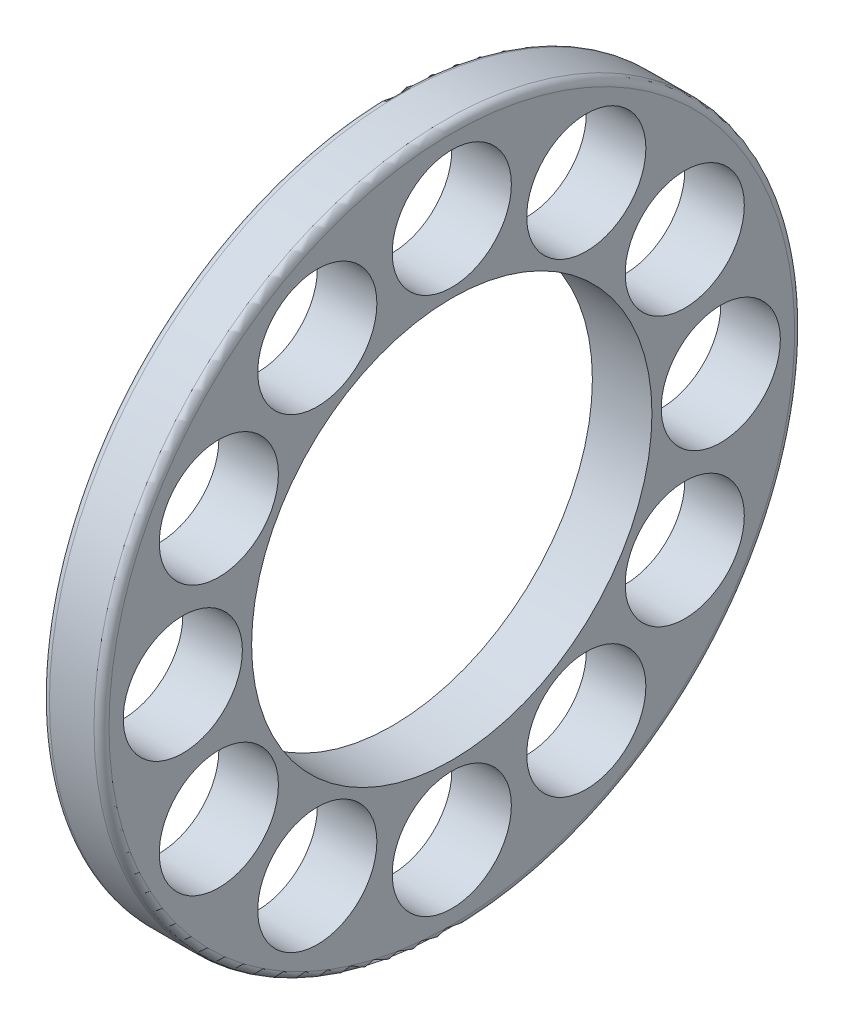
ISO-10303-21;
HEADER;
FILE_DESCRIPTION(('STEP AP214'),'2;1');
FILE_NAME('part.step','',(''),(''),'','','');
FILE_SCHEMA(('AUTOMOTIVE_DESIGN { 1 0 10303 214 1 1 1 1 }'));
ENDSEC;
DATA;
#1=APPLICATION_CONTEXT('core data for automotive mechanical design processes');
#2=APPLICATION_PROTOCOL_DEFINITION('international standard','automotive_design',2000,#1);
#3=PRODUCT_CONTEXT('',#1,'mechanical');
#4=PRODUCT('Part','Part','',(#3));
#5=PRODUCT_RELATED_PRODUCT_CATEGORY('part','',(#4));
#6=PRODUCT_DEFINITION_FORMATION('','',#4);
#7=PRODUCT_DEFINITION_CONTEXT('part definition',#1,'design');
#8=PRODUCT_DEFINITION('design','',#6,#7);
#9=PRODUCT_DEFINITION_SHAPE('','',#8);
#10=(LENGTH_UNIT() NAMED_UNIT(*) SI_UNIT(.MILLI.,.METRE.));
#11=(NAMED_UNIT(*) PLANE_ANGLE_UNIT() SI_UNIT($,.RADIAN.));
#12=(NAMED_UNIT(*) SI_UNIT($,.STERADIAN.) SOLID_ANGLE_UNIT());
#13=UNCERTAINTY_MEASURE_WITH_UNIT(LENGTH_MEASURE(1.E-05),#10,'distance_accuracy_value','');
#14=(GEOMETRIC_REPRESENTATION_CONTEXT(3) GLOBAL_UNCERTAINTY_ASSIGNED_CONTEXT((#13)) GLOBAL_UNIT_ASSIGNED_CONTEXT((#10,
#11,#12)) REPRESENTATION_CONTEXT('',''));
#15=CARTESIAN_POINT('',(0.,0.,0.));
#16=DIRECTION('',(0.,0.,1.));
#17=DIRECTION('',(1.,0.,0.));
#18=AXIS2_PLACEMENT_3D('',#15,#16,#17);
#19=CARTESIAN_POINT('',(3.3095,-13.9544959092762,-13.7));
#20=DIRECTION('',(-1.,0.,0.));
#21=DIRECTION('',(0.,0.,1.));
#22=AXIS2_PLACEMENT_3D('',#19,#20,#21);
#23=PLANE('',#22);
#24=CARTESIAN_POINT('',(3.3095,0.,0.));
#25=DIRECTION('',(-1.,0.,0.));
#26=DIRECTION('',(0.,0.,-1.));
#27=AXIS2_PLACEMENT_3D('',#24,#25,#26);
#28=CIRCLE('',#27,13.7000000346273);
#29=CARTESIAN_POINT('',(3.3095,0.,-13.7000000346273));
#30=VERTEX_POINT('',#29);
#31=EDGE_CURVE('E110',#30,#30,#28,.F.);
#32=ORIENTED_EDGE('',*,*,#31,.F.);
#33=EDGE_LOOP('',(#32));
#34=FACE_BOUND('',#33,.T.);
#35=CARTESIAN_POINT('',(3.3095,0.,0.));
#36=DIRECTION('',(1.,0.,0.));
#37=DIRECTION('',(0.,0.,1.));
#38=AXIS2_PLACEMENT_3D('',#35,#36,#37);
#39=CIRCLE('',#38,8.);
#40=CARTESIAN_POINT('',(3.3095,0.,8.));
#41=VERTEX_POINT('',#40);
#42=EDGE_CURVE('E107',#41,#41,#39,.T.);
#43=ORIENTED_EDGE('',*,*,#42,.T.);
#44=EDGE_LOOP('',(#43));
#45=FACE_BOUND('',#44,.T.);
#46=CARTESIAN_POINT('',(3.3095,5.375,9.3097730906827));
#47=DIRECTION('',(1.,0.,0.));
#48=DIRECTION('',(0.,0.,1.));
#49=AXIS2_PLACEMENT_3D('',#46,#47,#48);
#50=CIRCLE('',#49,2.381);
#51=CARTESIAN_POINT('',(3.3095,5.375,11.6907730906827));
#52=VERTEX_POINT('',#51);
#53=EDGE_CURVE('E104',#52,#52,#50,.T.);
#54=ORIENTED_EDGE('',*,*,#53,.T.);
#55=EDGE_LOOP('',(#54));
#56=FACE_BOUND('',#55,.T.);
#57=CARTESIAN_POINT('',(3.3095,0.,10.75));
#58=DIRECTION('',(1.,0.,0.));
#59=DIRECTION('',(0.,0.,1.));
#60=AXIS2_PLACEMENT_3D('',#57,#58,#59);
#61=CIRCLE('',#60,2.381);
#62=CARTESIAN_POINT('',(3.3095,0.,13.131));
#63=VERTEX_POINT('',#62);
#64=EDGE_CURVE('E101',#63,#63,#61,.T.);
#65=ORIENTED_EDGE('',*,*,#64,.T.);
#66=EDGE_LOOP('',(#65));
#67=FACE_BOUND('',#66,.T.);
#68=CARTESIAN_POINT('',(3.3095,-9.3097730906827,5.375));
#69=DIRECTION('',(1.,0.,0.));
#70=DIRECTION('',(0.,0.,1.));
#71=AXIS2_PLACEMENT_3D('',#68,#69,#70);
#72=CIRCLE('',#71,2.381);
#73=CARTESIAN_POINT('',(3.3095,-9.3097730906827,7.756));
#74=VERTEX_POINT('',#73);
#75=EDGE_CURVE('E98',#74,#74,#72,.T.);
#76=ORIENTED_EDGE('',*,*,#75,.T.);
#77=EDGE_LOOP('',(#76));
#78=FACE_BOUND('',#77,.T.);
#79=CARTESIAN_POINT('',(3.3095,-5.375,9.3097730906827));
#80=DIRECTION('',(1.,0.,0.));
#81=DIRECTION('',(0.,0.,1.));
#82=AXIS2_PLACEMENT_3D('',#79,#80,#81);
#83=CIRCLE('',#82,2.381);
#84=CARTESIAN_POINT('',(3.3095,-5.375,11.6907730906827));
#85=VERTEX_POINT('',#84);
#86=EDGE_CURVE('E95',#85,#85,#83,.T.);
#87=ORIENTED_EDGE('',*,*,#86,.T.);
#88=EDGE_LOOP('',(#87));
#89=FACE_BOUND('',#88,.T.);
#90=CARTESIAN_POINT('',(3.3095,0.,-10.75));
#91=DIRECTION('',(1.,0.,0.));
#92=DIRECTION('',(0.,0.,1.));
#93=AXIS2_PLACEMENT_3D('',#90,#91,#92);
#94=CIRCLE('',#93,2.381);
#95=CARTESIAN_POINT('',(3.3095,0.,-8.369));
#96=VERTEX_POINT('',#95);
#97=EDGE_CURVE('E92',#96,#96,#94,.T.);
#98=ORIENTED_EDGE('',*,*,#97,.T.);
#99=EDGE_LOOP('',(#98));
#100=FACE_BOUND('',#99,.T.);
#101=CARTESIAN_POINT('',(3.3095,-5.375,-9.3097730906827));
#102=DIRECTION('',(1.,0.,0.));
#103=DIRECTION('',(0.,0.,1.));
#104=AXIS2_PLACEMENT_3D('',#101,#102,#103);
#105=CIRCLE('',#104,2.381);
#106=CARTESIAN_POINT('',(3.3095,-5.375,-6.9287730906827));
#107=VERTEX_POINT('',#106);
#108=EDGE_CURVE('E89',#107,#107,#105,.T.);
#109=ORIENTED_EDGE('',*,*,#108,.T.);
#110=EDGE_LOOP('',(#109));
#111=FACE_BOUND('',#110,.T.);
#112=CARTESIAN_POINT('',(3.3095,-9.3097730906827,-5.375));
#113=DIRECTION('',(1.,0.,0.));
#114=DIRECTION('',(0.,0.,1.));
#115=AXIS2_PLACEMENT_3D('',#112,#113,#114);
#116=CIRCLE('',#115,2.381);
#117=CARTESIAN_POINT('',(3.3095,-9.3097730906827,-2.994));
#118=VERTEX_POINT('',#117);
#119=EDGE_CURVE('E86',#118,#118,#116,.T.);
#120=ORIENTED_EDGE('',*,*,#119,.T.);
#121=EDGE_LOOP('',(#120));
#122=FACE_BOUND('',#121,.T.);
#123=CARTESIAN_POINT('',(3.3095,-10.75,0.));
#124=DIRECTION('',(1.,0.,0.));
#125=DIRECTION('',(0.,0.,1.));
#126=AXIS2_PLACEMENT_3D('',#123,#124,#125);
#127=CIRCLE('',#126,2.381);
#128=CARTESIAN_POINT('',(3.3095,-10.75,2.381));
#129=VERTEX_POINT('',#128);
#130=EDGE_CURVE('E83',#129,#129,#127,.T.);
#131=ORIENTED_EDGE('',*,*,#130,.T.);
#132=EDGE_LOOP('',(#131));
#133=FACE_BOUND('',#132,.T.);
#134=CARTESIAN_POINT('',(3.3095,9.3097730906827,-5.375));
#135=DIRECTION('',(1.,0.,0.));
#136=DIRECTION('',(0.,0.,1.));
#137=AXIS2_PLACEMENT_3D('',#134,#135,#136);
#138=CIRCLE('',#137,2.381);
#139=CARTESIAN_POINT('',(3.3095,9.30977309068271,-2.994));
#140=VERTEX_POINT('',#139);
#141=EDGE_CURVE('E80',#140,#140,#138,.T.);
#142=ORIENTED_EDGE('',*,*,#141,.T.);
#143=EDGE_LOOP('',(#142));
#144=FACE_BOUND('',#143,.T.);
#145=CARTESIAN_POINT('',(3.3095,5.375,-9.3097730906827));
#146=DIRECTION('',(1.,0.,0.));
#147=DIRECTION('',(0.,0.,1.));
#148=AXIS2_PLACEMENT_3D('',#145,#146,#147);
#149=CIRCLE('',#148,2.381);
#150=CARTESIAN_POINT('',(3.3095,5.375,-6.9287730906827));
#151=VERTEX_POINT('',#150);
#152=EDGE_CURVE('E77',#151,#151,#149,.T.);
#153=ORIENTED_EDGE('',*,*,#152,.T.);
#154=EDGE_LOOP('',(#153));
#155=FACE_BOUND('',#154,.T.);
#156=CARTESIAN_POINT('',(3.3095,9.3097730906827,5.375));
#157=DIRECTION('',(1.,0.,0.));
#158=DIRECTION('',(0.,0.,1.));
#159=AXIS2_PLACEMENT_3D('',#156,#157,#158);
#160=CIRCLE('',#159,2.381);
#161=CARTESIAN_POINT('',(3.3095,9.30977309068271,7.756));
#162=VERTEX_POINT('',#161);
#163=EDGE_CURVE('E74',#162,#162,#160,.T.);
#164=ORIENTED_EDGE('',*,*,#163,.T.);
#165=EDGE_LOOP('',(#164));
#166=FACE_BOUND('',#165,.T.);
#167=CARTESIAN_POINT('',(3.3095,10.75,0.));
#168=DIRECTION('',(1.,0.,0.));
#169=DIRECTION('',(0.,0.,1.));
#170=AXIS2_PLACEMENT_3D('',#167,#168,#169);
#171=CIRCLE('',#170,2.381);
#172=CARTESIAN_POINT('',(3.3095,10.75,2.381));
#173=VERTEX_POINT('',#172);
#174=EDGE_CURVE('E71',#173,#173,#171,.T.);
#175=ORIENTED_EDGE('',*,*,#174,.T.);
#176=EDGE_LOOP('',(#175));
#177=FACE_BOUND('',#176,.T.);
#178=ADVANCED_FACE('F15',(#34,#45,#56,#67,#78,#89,#100,#111,#122,#133,#144,#155,#166,#177),#23,.T.);
#179=CARTESIAN_POINT('',(5.6905,-13.9544959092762,13.7));
#180=DIRECTION('',(1.,0.,0.));
#181=DIRECTION('',(0.,0.,-1.));
#182=AXIS2_PLACEMENT_3D('',#179,#180,#181);
#183=PLANE('',#182);
#184=CARTESIAN_POINT('',(5.6905,0.,0.));
#185=DIRECTION('',(1.,0.,0.));
#186=DIRECTION('',(0.,0.,1.));
#187=AXIS2_PLACEMENT_3D('',#184,#185,#186);
#188=CIRCLE('',#187,13.7);
#189=CARTESIAN_POINT('',(5.6905,0.,13.7));
#190=VERTEX_POINT('',#189);
#191=EDGE_CURVE('E68',#190,#190,#188,.T.);
#192=ORIENTED_EDGE('',*,*,#191,.T.);
#193=EDGE_LOOP('',(#192));
#194=FACE_BOUND('',#193,.T.);
#195=CARTESIAN_POINT('',(5.6905,0.,0.));
#196=DIRECTION('',(-1.,0.,0.));
#197=DIRECTION('',(0.,0.,-1.));
#198=AXIS2_PLACEMENT_3D('',#195,#196,#197);
#199=CIRCLE('',#198,8.);
#200=CARTESIAN_POINT('',(5.6905,0.,-8.));
#201=VERTEX_POINT('',#200);
#202=EDGE_CURVE('E65',#201,#201,#199,.F.);
#203=ORIENTED_EDGE('',*,*,#202,.F.);
#204=EDGE_LOOP('',(#203));
#205=FACE_BOUND('',#204,.T.);
#206=CARTESIAN_POINT('',(5.6905,5.375,9.3097730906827));
#207=DIRECTION('',(-1.,0.,0.));
#208=DIRECTION('',(0.,0.,-1.));
#209=AXIS2_PLACEMENT_3D('',#206,#207,#208);
#210=CIRCLE('',#209,2.381);
#211=CARTESIAN_POINT('',(5.6905,5.375,6.9287730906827));
#212=VERTEX_POINT('',#211);
#213=EDGE_CURVE('E62',#212,#212,#210,.T.);
#214=ORIENTED_EDGE('',*,*,#213,.T.);
#215=EDGE_LOOP('',(#214));
#216=FACE_BOUND('',#215,.T.);
#217=CARTESIAN_POINT('',(5.6905,0.,10.75));
#218=DIRECTION('',(-1.,0.,0.));
#219=DIRECTION('',(0.,0.,-1.));
#220=AXIS2_PLACEMENT_3D('',#217,#218,#219);
#221=CIRCLE('',#220,2.381);
#222=CARTESIAN_POINT('',(5.6905,0.,8.369));
#223=VERTEX_POINT('',#222);
#224=EDGE_CURVE('E59',#223,#223,#221,.T.);
#225=ORIENTED_EDGE('',*,*,#224,.T.);
#226=EDGE_LOOP('',(#225));
#227=FACE_BOUND('',#226,.T.);
#228=CARTESIAN_POINT('',(5.6905,-9.3097730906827,5.375));
#229=DIRECTION('',(-1.,0.,0.));
#230=DIRECTION('',(0.,0.,-1.));
#231=AXIS2_PLACEMENT_3D('',#228,#229,#230);
#232=CIRCLE('',#231,2.381);
#233=CARTESIAN_POINT('',(5.6905,-9.3097730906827,2.994));
#234=VERTEX_POINT('',#233);
#235=EDGE_CURVE('E56',#234,#234,#232,.T.);
#236=ORIENTED_EDGE('',*,*,#235,.T.);
#237=EDGE_LOOP('',(#236));
#238=FACE_BOUND('',#237,.T.);
#239=CARTESIAN_POINT('',(5.6905,-5.375,9.3097730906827));
#240=DIRECTION('',(-1.,0.,0.));
#241=DIRECTION('',(0.,0.,-1.));
#242=AXIS2_PLACEMENT_3D('',#239,#240,#241);
#243=CIRCLE('',#242,2.381);
#244=CARTESIAN_POINT('',(5.6905,-5.375,6.9287730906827));
#245=VERTEX_POINT('',#244);
#246=EDGE_CURVE('E53',#245,#245,#243,.T.);
#247=ORIENTED_EDGE('',*,*,#246,.T.);
#248=EDGE_LOOP('',(#247));
#249=FACE_BOUND('',#248,.T.);
#250=CARTESIAN_POINT('',(5.6905,0.,-10.75));
#251=DIRECTION('',(-1.,0.,0.));
#252=DIRECTION('',(0.,0.,-1.));
#253=AXIS2_PLACEMENT_3D('',#250,#251,#252);
#254=CIRCLE('',#253,2.381);
#255=CARTESIAN_POINT('',(5.6905,0.,-13.131));
#256=VERTEX_POINT('',#255);
#257=EDGE_CURVE('E50',#256,#256,#254,.T.);
#258=ORIENTED_EDGE('',*,*,#257,.T.);
#259=EDGE_LOOP('',(#258));
#260=FACE_BOUND('',#259,.T.);
#261=CARTESIAN_POINT('',(5.6905,-5.375,-9.3097730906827));
#262=DIRECTION('',(-1.,0.,0.));
#263=DIRECTION('',(0.,0.,-1.));
#264=AXIS2_PLACEMENT_3D('',#261,#262,#263);
#265=CIRCLE('',#264,2.381);
#266=CARTESIAN_POINT('',(5.6905,-5.375,-11.6907730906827));
#267=VERTEX_POINT('',#266);
#268=EDGE_CURVE('E47',#267,#267,#265,.T.);
#269=ORIENTED_EDGE('',*,*,#268,.T.);
#270=EDGE_LOOP('',(#269));
#271=FACE_BOUND('',#270,.T.);
#272=CARTESIAN_POINT('',(5.6905,-9.3097730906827,-5.375));
#273=DIRECTION('',(-1.,0.,0.));
#274=DIRECTION('',(0.,0.,-1.));
#275=AXIS2_PLACEMENT_3D('',#272,#273,#274);
#276=CIRCLE('',#275,2.381);
#277=CARTESIAN_POINT('',(5.6905,-9.3097730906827,-7.756));
#278=VERTEX_POINT('',#277);
#279=EDGE_CURVE('E44',#278,#278,#276,.T.);
#280=ORIENTED_EDGE('',*,*,#279,.T.);
#281=EDGE_LOOP('',(#280));
#282=FACE_BOUND('',#281,.T.);
#283=CARTESIAN_POINT('',(5.6905,-10.75,0.));
#284=DIRECTION('',(-1.,0.,0.));
#285=DIRECTION('',(0.,0.,-1.));
#286=AXIS2_PLACEMENT_3D('',#283,#284,#285);
#287=CIRCLE('',#286,2.381);
#288=CARTESIAN_POINT('',(5.6905,-10.75,-2.381));
#289=VERTEX_POINT('',#288);
#290=EDGE_CURVE('E41',#289,#289,#287,.T.);
#291=ORIENTED_EDGE('',*,*,#290,.T.);
#292=EDGE_LOOP('',(#291));
#293=FACE_BOUND('',#292,.T.);
#294=CARTESIAN_POINT('',(5.6905,9.3097730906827,-5.375));
#295=DIRECTION('',(-1.,0.,0.));
#296=DIRECTION('',(0.,-1.42053928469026E-07,-0.99999999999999));
#297=AXIS2_PLACEMENT_3D('',#294,#295,#296);
#298=CIRCLE('',#297,2.381);
#299=CARTESIAN_POINT('',(5.6905,9.3097727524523,-7.75599999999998));
#300=VERTEX_POINT('',#299);
#301=EDGE_CURVE('E38',#300,#300,#298,.T.);
#302=ORIENTED_EDGE('',*,*,#301,.T.);
#303=EDGE_LOOP('',(#302));
#304=FACE_BOUND('',#303,.T.);
#305=CARTESIAN_POINT('',(5.6905,5.375,-9.3097730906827));
#306=DIRECTION('',(-1.,0.,0.));
#307=DIRECTION('',(0.,0.,-1.));
#308=AXIS2_PLACEMENT_3D('',#305,#306,#307);
#309=CIRCLE('',#308,2.381);
#310=CARTESIAN_POINT('',(5.6905,5.375,-11.6907730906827));
#311=VERTEX_POINT('',#310);
#312=EDGE_CURVE('E35',#311,#311,#309,.T.);
#313=ORIENTED_EDGE('',*,*,#312,.T.);
#314=EDGE_LOOP('',(#313));
#315=FACE_BOUND('',#314,.T.);
#316=CARTESIAN_POINT('',(5.6905,9.3097730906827,5.375));
#317=DIRECTION('',(-1.,0.,0.));
#318=DIRECTION('',(0.,0.,-1.));
#319=AXIS2_PLACEMENT_3D('',#316,#317,#318);
#320=CIRCLE('',#319,2.381);
#321=CARTESIAN_POINT('',(5.6905,9.3097730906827,2.994));
#322=VERTEX_POINT('',#321);
#323=EDGE_CURVE('E30',#322,#322,#320,.T.);
#324=ORIENTED_EDGE('',*,*,#323,.T.);
#325=EDGE_LOOP('',(#324));
#326=FACE_BOUND('',#325,.T.);
#327=CARTESIAN_POINT('',(5.6905,10.75,0.));
#328=DIRECTION('',(-1.,0.,0.));
#329=DIRECTION('',(0.,-1.42053904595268E-07,-0.99999999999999));
#330=AXIS2_PLACEMENT_3D('',#327,#328,#329);
#331=CIRCLE('',#330,2.381);
#332=CARTESIAN_POINT('',(5.6905,10.7499996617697,-2.38099999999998));
#333=VERTEX_POINT('',#332);
#334=EDGE_CURVE('E26',#333,#333,#331,.T.);
#335=ORIENTED_EDGE('',*,*,#334,.T.);
#336=EDGE_LOOP('',(#335));
#337=FACE_BOUND('',#336,.T.);
#338=ADVANCED_FACE('F119',(#194,#205,#216,#227,#238,#249,#260,#271,#282,#293,#304,#315,#326,
#337),#183,.T.);
#339=CARTESIAN_POINT('',(3.60949999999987,0.,0.));
#340=DIRECTION('',(1.,0.,0.));
#341=DIRECTION('',(0.,1.92336047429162E-10,1.));
#342=AXIS2_PLACEMENT_3D('',#339,#340,#341);
#343=TOROIDAL_SURFACE('',#342,13.7000000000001,0.299999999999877);
#344=ORIENTED_EDGE('',*,*,#31,.T.);
#345=EDGE_LOOP('',(#344));
#346=FACE_BOUND('',#345,.T.);
#347=CARTESIAN_POINT('',(3.60949999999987,0.,0.));
#348=DIRECTION('',(-1.,0.,0.));
#349=DIRECTION('',(0.,0.,-1.));
#350=AXIS2_PLACEMENT_3D('',#347,#348,#349);
#351=CIRCLE('',#350,14.);
#352=CARTESIAN_POINT('',(3.60949999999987,0.,-14.));
#353=VERTEX_POINT('',#352);
#354=EDGE_CURVE('E22',#353,#353,#351,.F.);
#355=ORIENTED_EDGE('',*,*,#354,.F.);
#356=EDGE_LOOP('',(#355));
#357=FACE_BOUND('',#356,.T.);
#358=ADVANCED_FACE('F114',(#346,#357),#343,.T.);
#359=CARTESIAN_POINT('',(5.6905,0.,0.));
#360=DIRECTION('',(1.,0.,0.));
#361=DIRECTION('',(0.,0.,1.));
#362=AXIS2_PLACEMENT_3D('',#359,#360,#361);
#363=CYLINDRICAL_SURFACE('',#362,8.);
#364=ORIENTED_EDGE('',*,*,#202,.T.);
#365=EDGE_LOOP('',(#364));
#366=FACE_BOUND('',#365,.T.);
#367=ORIENTED_EDGE('',*,*,#42,.F.);
#368=EDGE_LOOP('',(#367));
#369=FACE_BOUND('',#368,.T.);
#370=ADVANCED_FACE('F162',(#366,#369),#363,.F.);
#371=CARTESIAN_POINT('',(5.39050000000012,0.,0.));
#372=DIRECTION('',(1.,0.,0.));
#373=DIRECTION('',(0.,0.,1.));
#374=AXIS2_PLACEMENT_3D('',#371,#372,#373);
#375=TOROIDAL_SURFACE('',#374,13.7000000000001,0.299999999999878);
#376=CARTESIAN_POINT('',(5.39050000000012,0.,0.));
#377=DIRECTION('',(1.,0.,0.));
#378=DIRECTION('',(0.,0.,1.));
#379=AXIS2_PLACEMENT_3D('',#376,#377,#378);
#380=CIRCLE('',#379,14.);
#381=CARTESIAN_POINT('',(5.39050000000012,0.,14.));
#382=VERTEX_POINT('',#381);
#383=EDGE_CURVE('E10',#382,#382,#380,.T.);
#384=ORIENTED_EDGE('',*,*,#383,.T.);
#385=EDGE_LOOP('',(#384));
#386=FACE_BOUND('',#385,.T.);
#387=ORIENTED_EDGE('',*,*,#191,.F.);
#388=EDGE_LOOP('',(#387));
#389=FACE_BOUND('',#388,.T.);
#390=ADVANCED_FACE('F168',(#386,#389),#375,.T.);
#391=CARTESIAN_POINT('',(5.6905,0.,0.));
#392=DIRECTION('',(1.,0.,0.));
#393=DIRECTION('',(0.,1.92336047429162E-10,1.));
#394=AXIS2_PLACEMENT_3D('',#391,#392,#393);
#395=CYLINDRICAL_SURFACE('',#394,14.);
#396=ORIENTED_EDGE('',*,*,#354,.T.);
#397=EDGE_LOOP('',(#396));
#398=FACE_BOUND('',#397,.T.);
#399=ORIENTED_EDGE('',*,*,#383,.F.);
#400=EDGE_LOOP('',(#399));
#401=FACE_BOUND('',#400,.T.);
#402=ADVANCED_FACE('F151',(#398,#401),#395,.T.);
#403=CARTESIAN_POINT('',(9.,10.75,0.));
#404=DIRECTION('',(-1.,0.,0.));
#405=DIRECTION('',(0.,0.,-1.));
#406=AXIS2_PLACEMENT_3D('',#403,#404,#405);
#407=CYLINDRICAL_SURFACE('',#406,2.381);
#408=ORIENTED_EDGE('',*,*,#174,.F.);
#409=EDGE_LOOP('',(#408));
#410=FACE_BOUND('',#409,.T.);
#411=ORIENTED_EDGE('',*,*,#334,.F.);
#412=EDGE_LOOP('',(#411));
#413=FACE_BOUND('',#412,.T.);
#414=ADVANCED_FACE('F147',(#410,#413),#407,.F.);
#415=CARTESIAN_POINT('',(9.,9.3097730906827,5.375));
#416=DIRECTION('',(-1.,0.,0.));
#417=DIRECTION('',(0.,0.,-1.));
#418=AXIS2_PLACEMENT_3D('',#415,#416,#417);
#419=CYLINDRICAL_SURFACE('',#418,2.381);
#420=ORIENTED_EDGE('',*,*,#163,.F.);
#421=EDGE_LOOP('',(#420));
#422=FACE_BOUND('',#421,.T.);
#423=ORIENTED_EDGE('',*,*,#323,.F.);
#424=EDGE_LOOP('',(#423));
#425=FACE_BOUND('',#424,.T.);
#426=ADVANCED_FACE('F150',(#422,#425),#419,.F.);
#427=CARTESIAN_POINT('',(9.,5.375,-9.3097730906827));
#428=DIRECTION('',(-1.,0.,0.));
#429=DIRECTION('',(0.,0.,-1.));
#430=AXIS2_PLACEMENT_3D('',#427,#428,#429);
#431=CYLINDRICAL_SURFACE('',#430,2.381);
#432=ORIENTED_EDGE('',*,*,#152,.F.);
#433=EDGE_LOOP('',(#432));
#434=FACE_BOUND('',#433,.T.);
#435=ORIENTED_EDGE('',*,*,#312,.F.);
#436=EDGE_LOOP('',(#435));
#437=FACE_BOUND('',#436,.T.);
#438=ADVANCED_FACE('F176',(#434,#437),#431,.F.);
#439=CARTESIAN_POINT('',(9.,9.3097730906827,-5.375));
#440=DIRECTION('',(-1.,0.,0.));
#441=DIRECTION('',(0.,0.,-1.));
#442=AXIS2_PLACEMENT_3D('',#439,#440,#441);
#443=CYLINDRICAL_SURFACE('',#442,2.381);
#444=ORIENTED_EDGE('',*,*,#141,.F.);
#445=EDGE_LOOP('',(#444));
#446=FACE_BOUND('',#445,.T.);
#447=ORIENTED_EDGE('',*,*,#301,.F.);
#448=EDGE_LOOP('',(#447));
#449=FACE_BOUND('',#448,.T.);
#450=ADVANCED_FACE('F180',(#446,#449),#443,.F.);
#451=CARTESIAN_POINT('',(9.,-10.75,0.));
#452=DIRECTION('',(-1.,0.,0.));
#453=DIRECTION('',(0.,0.,-1.));
#454=AXIS2_PLACEMENT_3D('',#451,#452,#453);
#455=CYLINDRICAL_SURFACE('',#454,2.381);
#456=ORIENTED_EDGE('',*,*,#130,.F.);
#457=EDGE_LOOP('',(#456));
#458=FACE_BOUND('',#457,.T.);
#459=ORIENTED_EDGE('',*,*,#290,.F.);
#460=EDGE_LOOP('',(#459));
#461=FACE_BOUND('',#460,.T.);
#462=ADVANCED_FACE('F184',(#458,#461),#455,.F.);
#463=CARTESIAN_POINT('',(9.,-9.3097730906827,-5.375));
#464=DIRECTION('',(-1.,0.,0.));
#465=DIRECTION('',(0.,1.42053926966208E-07,-0.99999999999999));
#466=AXIS2_PLACEMENT_3D('',#463,#464,#465);
#467=CYLINDRICAL_SURFACE('',#466,2.381);
#468=ORIENTED_EDGE('',*,*,#119,.F.);
#469=EDGE_LOOP('',(#468));
#470=FACE_BOUND('',#469,.T.);
#471=ORIENTED_EDGE('',*,*,#279,.F.);
#472=EDGE_LOOP('',(#471));
#473=FACE_BOUND('',#472,.T.);
#474=ADVANCED_FACE('F188',(#470,#473),#467,.F.);
#475=CARTESIAN_POINT('',(9.,-5.375,-9.3097730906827));
#476=DIRECTION('',(-1.,0.,0.));
#477=DIRECTION('',(0.,0.,-1.));
#478=AXIS2_PLACEMENT_3D('',#475,#476,#477);
#479=CYLINDRICAL_SURFACE('',#478,2.381);
#480=ORIENTED_EDGE('',*,*,#108,.F.);
#481=EDGE_LOOP('',(#480));
#482=FACE_BOUND('',#481,.T.);
#483=ORIENTED_EDGE('',*,*,#268,.F.);
#484=EDGE_LOOP('',(#483));
#485=FACE_BOUND('',#484,.T.);
#486=ADVANCED_FACE('F192',(#482,#485),#479,.F.);
#487=CARTESIAN_POINT('',(9.,0.,-10.75));
#488=DIRECTION('',(-1.,0.,0.));
#489=DIRECTION('',(0.,0.,-1.));
#490=AXIS2_PLACEMENT_3D('',#487,#488,#489);
#491=CYLINDRICAL_SURFACE('',#490,2.381);
#492=ORIENTED_EDGE('',*,*,#97,.F.);
#493=EDGE_LOOP('',(#492));
#494=FACE_BOUND('',#493,.T.);
#495=ORIENTED_EDGE('',*,*,#257,.F.);
#496=EDGE_LOOP('',(#495));
#497=FACE_BOUND('',#496,.T.);
#498=ADVANCED_FACE('F196',(#494,#497),#491,.F.);
#499=CARTESIAN_POINT('',(9.,-5.375,9.3097730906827));
#500=DIRECTION('',(-1.,0.,0.));
#501=DIRECTION('',(0.,0.,-1.));
#502=AXIS2_PLACEMENT_3D('',#499,#500,#501);
#503=CYLINDRICAL_SURFACE('',#502,2.381);
#504=ORIENTED_EDGE('',*,*,#86,.F.);
#505=EDGE_LOOP('',(#504));
#506=FACE_BOUND('',#505,.T.);
#507=ORIENTED_EDGE('',*,*,#246,.F.);
#508=EDGE_LOOP('',(#507));
#509=FACE_BOUND('',#508,.T.);
#510=ADVANCED_FACE('F200',(#506,#509),#503,.F.);
#511=CARTESIAN_POINT('',(9.,-9.3097730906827,5.375));
#512=DIRECTION('',(-1.,0.,0.));
#513=DIRECTION('',(0.,1.42053886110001E-07,-0.99999999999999));
#514=AXIS2_PLACEMENT_3D('',#511,#512,#513);
#515=CYLINDRICAL_SURFACE('',#514,2.381);
#516=ORIENTED_EDGE('',*,*,#75,.F.);
#517=EDGE_LOOP('',(#516));
#518=FACE_BOUND('',#517,.T.);
#519=ORIENTED_EDGE('',*,*,#235,.F.);
#520=EDGE_LOOP('',(#519));
#521=FACE_BOUND('',#520,.T.);
#522=ADVANCED_FACE('F204',(#518,#521),#515,.F.);
#523=CARTESIAN_POINT('',(9.,0.,10.75));
#524=DIRECTION('',(-1.,0.,0.));
#525=DIRECTION('',(0.,0.,-1.));
#526=AXIS2_PLACEMENT_3D('',#523,#524,#525);
#527=CYLINDRICAL_SURFACE('',#526,2.381);
#528=ORIENTED_EDGE('',*,*,#64,.F.);
#529=EDGE_LOOP('',(#528));
#530=FACE_BOUND('',#529,.T.);
#531=ORIENTED_EDGE('',*,*,#224,.F.);
#532=EDGE_LOOP('',(#531));
#533=FACE_BOUND('',#532,.T.);
#534=ADVANCED_FACE('F207',(#530,#533),#527,.F.);
#535=CARTESIAN_POINT('',(9.,5.375,9.3097730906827));
#536=DIRECTION('',(-1.,0.,0.));
#537=DIRECTION('',(0.,0.,-1.));
#538=AXIS2_PLACEMENT_3D('',#535,#536,#537);
#539=CYLINDRICAL_SURFACE('',#538,2.381);
#540=ORIENTED_EDGE('',*,*,#53,.F.);
#541=EDGE_LOOP('',(#540));
#542=FACE_BOUND('',#541,.T.);
#543=ORIENTED_EDGE('',*,*,#213,.F.);
#544=EDGE_LOOP('',(#543));
#545=FACE_BOUND('',#544,.T.);
#546=ADVANCED_FACE('F17',(#542,#545),#539,.F.);
#547=CLOSED_SHELL('',(#178,#338,#358,#370,#390,#402,#414,#426,#438,#450,#462,#474,#486,#498,
#510,#522,#534,#546));
#548=MANIFOLD_SOLID_BREP('B1',#547);
#549=ADVANCED_BREP_SHAPE_REPRESENTATION('',(#18,#548),#14);
#550=SHAPE_DEFINITION_REPRESENTATION(#9,#549);
ENDSEC;
END-ISO-10303-21;
